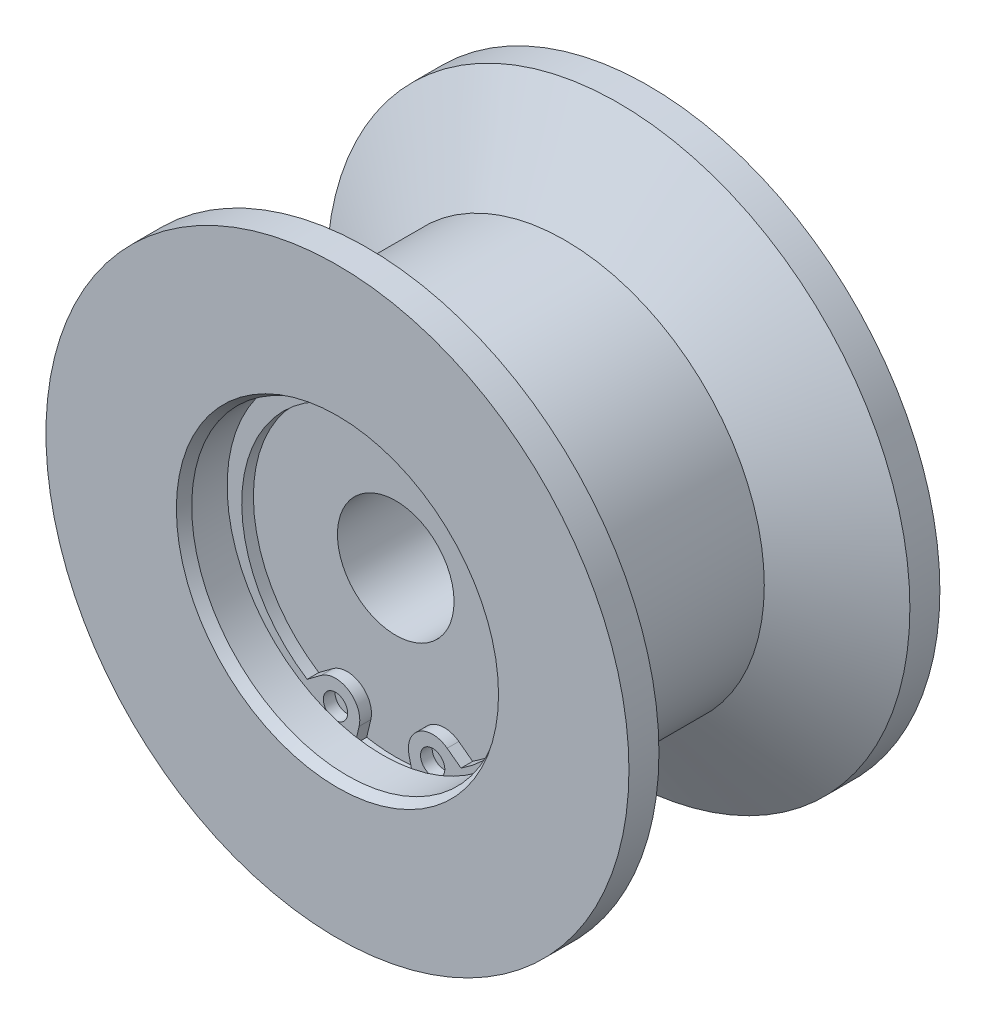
ISO-10303-21;
HEADER;
FILE_DESCRIPTION(('STEP AP214'),'2;1');
FILE_NAME('part.step','',(''),(''),'','','');
FILE_SCHEMA(('AUTOMOTIVE_DESIGN { 1 0 10303 214 1 1 1 1 }'));
ENDSEC;
DATA;
#1=APPLICATION_CONTEXT('core data for automotive mechanical design processes');
#2=APPLICATION_PROTOCOL_DEFINITION('international standard','automotive_design',2000,#1);
#3=PRODUCT_CONTEXT('',#1,'mechanical');
#4=PRODUCT('Part','Part','',(#3));
#5=PRODUCT_RELATED_PRODUCT_CATEGORY('part','',(#4));
#6=PRODUCT_DEFINITION_FORMATION('','',#4);
#7=PRODUCT_DEFINITION_CONTEXT('part definition',#1,'design');
#8=PRODUCT_DEFINITION('design','',#6,#7);
#9=PRODUCT_DEFINITION_SHAPE('','',#8);
#10=(LENGTH_UNIT() NAMED_UNIT(*) SI_UNIT(.MILLI.,.METRE.));
#11=(NAMED_UNIT(*) PLANE_ANGLE_UNIT() SI_UNIT($,.RADIAN.));
#12=(NAMED_UNIT(*) SI_UNIT($,.STERADIAN.) SOLID_ANGLE_UNIT());
#13=UNCERTAINTY_MEASURE_WITH_UNIT(LENGTH_MEASURE(1.E-05),#10,'distance_accuracy_value','');
#14=(GEOMETRIC_REPRESENTATION_CONTEXT(3) GLOBAL_UNCERTAINTY_ASSIGNED_CONTEXT((#13)) GLOBAL_UNIT_ASSIGNED_CONTEXT((#10,
#11,#12)) REPRESENTATION_CONTEXT('',''));
#15=CARTESIAN_POINT('',(0.,0.,0.));
#16=DIRECTION('',(0.,0.,1.));
#17=DIRECTION('',(1.,0.,0.));
#18=AXIS2_PLACEMENT_3D('',#15,#16,#17);
#19=CARTESIAN_POINT('',(17.0522,-17.110876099,10.));
#20=DIRECTION('',(0.,0.,-1.));
#21=DIRECTION('',(-1.,0.,0.));
#22=AXIS2_PLACEMENT_3D('',#19,#20,#21);
#23=PLANE('',#22);
#24=CARTESIAN_POINT('',(5.,-14.2233767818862,10.));
#25=DIRECTION('',(0.,0.,1.));
#26=DIRECTION('',(1.,0.,0.));
#27=AXIS2_PLACEMENT_3D('',#24,#25,#26);
#28=CIRCLE('',#27,1.25);
#29=CARTESIAN_POINT('',(6.25,-14.2233767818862,10.));
#30=VERTEX_POINT('',#29);
#31=EDGE_CURVE('E117',#30,#30,#28,.T.);
#32=ORIENTED_EDGE('',*,*,#31,.T.);
#33=EDGE_LOOP('',(#32));
#34=FACE_BOUND('',#33,.T.);
#35=ADVANCED_FACE('F14',(#34),#23,.F.);
#36=CARTESIAN_POINT('',(-5.,-14.2233767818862,10.));
#37=DIRECTION('',(0.,0.,-1.));
#38=DIRECTION('',(1.,0.,0.));
#39=AXIS2_PLACEMENT_3D('',#36,#37,#38);
#40=CIRCLE('',#39,1.25);
#41=CARTESIAN_POINT('',(-3.75,-14.2233767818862,10.));
#42=VERTEX_POINT('',#41);
#43=EDGE_CURVE('E143',#42,#42,#40,.T.);
#44=ORIENTED_EDGE('',*,*,#43,.F.);
#45=EDGE_LOOP('',(#44));
#46=FACE_BOUND('',#45,.T.);
#47=ADVANCED_FACE('F249',(#46),#23,.F.);
#48=CARTESIAN_POINT('',(0.,0.,-7.42820323));
#49=DIRECTION('',(0.,0.,1.));
#50=DIRECTION('',(1.,0.,0.));
#51=AXIS2_PLACEMENT_3D('',#48,#49,#50);
#52=CYLINDRICAL_SURFACE('',#51,20.5);
#53=CARTESIAN_POINT('',(0.,0.,7.42820323));
#54=DIRECTION('',(0.,0.,1.));
#55=DIRECTION('',(1.,0.,0.));
#56=AXIS2_PLACEMENT_3D('',#53,#54,#55);
#57=CIRCLE('',#56,20.5);
#58=CARTESIAN_POINT('',(20.5,0.,7.42820323));
#59=VERTEX_POINT('',#58);
#60=EDGE_CURVE('E188',#59,#59,#57,.F.);
#61=ORIENTED_EDGE('',*,*,#60,.T.);
#62=EDGE_LOOP('',(#61));
#63=FACE_BOUND('',#62,.T.);
#64=CARTESIAN_POINT('',(0.,0.,-7.42820323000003));
#65=DIRECTION('',(0.,0.,-1.));
#66=DIRECTION('',(-1.,0.,0.));
#67=AXIS2_PLACEMENT_3D('',#64,#65,#66);
#68=CIRCLE('',#67,20.5);
#69=CARTESIAN_POINT('',(-20.5,0.,-7.42820323));
#70=VERTEX_POINT('',#69);
#71=EDGE_CURVE('E184',#70,#70,#68,.T.);
#72=ORIENTED_EDGE('',*,*,#71,.F.);
#73=EDGE_LOOP('',(#72));
#74=FACE_BOUND('',#73,.T.);
#75=ADVANCED_FACE('F243',(#63,#74),#52,.T.);
#76=CARTESIAN_POINT('',(0.,0.,7.42820323));
#77=DIRECTION('',(0.,0.,1.));
#78=DIRECTION('',(1.,0.,0.));
#79=AXIS2_PLACEMENT_3D('',#76,#77,#78);
#80=CONICAL_SURFACE('',#79,20.5,1.04719755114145);
#81=CARTESIAN_POINT('',(0.,0.,12.913030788));
#82=DIRECTION('',(0.,0.,1.));
#83=DIRECTION('',(1.,0.,0.));
#84=AXIS2_PLACEMENT_3D('',#81,#82,#83);
#85=CIRCLE('',#84,30.);
#86=CARTESIAN_POINT('',(30.,0.,12.913030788));
#87=VERTEX_POINT('',#86);
#88=EDGE_CURVE('E192',#87,#87,#85,.F.);
#89=ORIENTED_EDGE('',*,*,#88,.T.);
#90=EDGE_LOOP('',(#89));
#91=FACE_BOUND('',#90,.T.);
#92=ORIENTED_EDGE('',*,*,#60,.F.);
#93=EDGE_LOOP('',(#92));
#94=FACE_BOUND('',#93,.T.);
#95=ADVANCED_FACE('F240',(#91,#94),#80,.T.);
#96=CARTESIAN_POINT('',(0.,0.,-7.42820323));
#97=DIRECTION('',(0.,0.,-1.));
#98=DIRECTION('',(-1.,0.,0.));
#99=AXIS2_PLACEMENT_3D('',#96,#97,#98);
#100=CONICAL_SURFACE('',#99,20.5,1.04719755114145);
#101=CARTESIAN_POINT('',(0.,0.,-12.913030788));
#102=DIRECTION('',(0.,0.,1.));
#103=DIRECTION('',(1.,0.,0.));
#104=AXIS2_PLACEMENT_3D('',#101,#102,#103);
#105=CIRCLE('',#104,30.);
#106=CARTESIAN_POINT('',(30.,0.,-12.913030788));
#107=VERTEX_POINT('',#106);
#108=EDGE_CURVE('E179',#107,#107,#105,.F.);
#109=ORIENTED_EDGE('',*,*,#108,.F.);
#110=EDGE_LOOP('',(#109));
#111=FACE_BOUND('',#110,.T.);
#112=ORIENTED_EDGE('',*,*,#71,.T.);
#113=EDGE_LOOP('',(#112));
#114=FACE_BOUND('',#113,.T.);
#115=ADVANCED_FACE('F236',(#111,#114),#100,.T.);
#116=CARTESIAN_POINT('',(0.,0.,12.913030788));
#117=DIRECTION('',(0.,0.,1.));
#118=DIRECTION('',(1.,0.,0.));
#119=AXIS2_PLACEMENT_3D('',#116,#117,#118);
#120=CYLINDRICAL_SURFACE('',#119,30.);
#121=CARTESIAN_POINT('',(0.,0.,16.));
#122=DIRECTION('',(0.,0.,1.));
#123=DIRECTION('',(1.,0.,0.));
#124=AXIS2_PLACEMENT_3D('',#121,#122,#123);
#125=CIRCLE('',#124,30.);
#126=CARTESIAN_POINT('',(30.,0.,16.));
#127=VERTEX_POINT('',#126);
#128=EDGE_CURVE('E199',#127,#127,#125,.F.);
#129=ORIENTED_EDGE('',*,*,#128,.T.);
#130=EDGE_LOOP('',(#129));
#131=FACE_BOUND('',#130,.T.);
#132=ORIENTED_EDGE('',*,*,#88,.F.);
#133=EDGE_LOOP('',(#132));
#134=FACE_BOUND('',#133,.T.);
#135=ADVANCED_FACE('F233',(#131,#134),#120,.T.);
#136=CARTESIAN_POINT('',(0.,0.,-16.));
#137=DIRECTION('',(0.,0.,1.));
#138=DIRECTION('',(1.,0.,0.));
#139=AXIS2_PLACEMENT_3D('',#136,#137,#138);
#140=CYLINDRICAL_SURFACE('',#139,30.);
#141=ORIENTED_EDGE('',*,*,#108,.T.);
#142=EDGE_LOOP('',(#141));
#143=FACE_BOUND('',#142,.T.);
#144=CARTESIAN_POINT('',(0.,0.,-16.));
#145=DIRECTION('',(0.,0.,1.));
#146=DIRECTION('',(1.,0.,0.));
#147=AXIS2_PLACEMENT_3D('',#144,#145,#146);
#148=CIRCLE('',#147,30.);
#149=CARTESIAN_POINT('',(30.,0.,-16.));
#150=VERTEX_POINT('',#149);
#151=EDGE_CURVE('E206',#150,#150,#148,.T.);
#152=ORIENTED_EDGE('',*,*,#151,.T.);
#153=EDGE_LOOP('',(#152));
#154=FACE_BOUND('',#153,.T.);
#155=ADVANCED_FACE('F229',(#143,#154),#140,.T.);
#156=CARTESIAN_POINT('',(30.36,-30.464467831,16.));
#157=DIRECTION('',(0.,0.,-1.));
#158=DIRECTION('',(-1.,0.,0.));
#159=AXIS2_PLACEMENT_3D('',#156,#157,#158);
#160=PLANE('',#159);
#161=CARTESIAN_POINT('',(0.,0.,16.));
#162=DIRECTION('',(0.,0.,1.));
#163=DIRECTION('',(1.,0.,0.));
#164=AXIS2_PLACEMENT_3D('',#161,#162,#163);
#165=CIRCLE('',#164,16.577350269);
#166=CARTESIAN_POINT('',(16.577350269,0.,16.));
#167=VERTEX_POINT('',#166);
#168=EDGE_CURVE('E200',#167,#167,#165,.T.);
#169=ORIENTED_EDGE('',*,*,#168,.F.);
#170=EDGE_LOOP('',(#169));
#171=FACE_BOUND('',#170,.T.);
#172=ORIENTED_EDGE('',*,*,#128,.F.);
#173=EDGE_LOOP('',(#172));
#174=FACE_BOUND('',#173,.T.);
#175=ADVANCED_FACE('F226',(#171,#174),#160,.F.);
#176=CARTESIAN_POINT('',(-30.36,-30.464467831,-16.));
#177=DIRECTION('',(0.,0.,1.));
#178=DIRECTION('',(1.,0.,0.));
#179=AXIS2_PLACEMENT_3D('',#176,#177,#178);
#180=PLANE('',#179);
#181=CARTESIAN_POINT('',(0.,0.,-16.));
#182=DIRECTION('',(0.,0.,1.));
#183=DIRECTION('',(1.,0.,0.));
#184=AXIS2_PLACEMENT_3D('',#181,#182,#183);
#185=CIRCLE('',#184,13.);
#186=CARTESIAN_POINT('',(13.,0.,-16.));
#187=VERTEX_POINT('',#186);
#188=EDGE_CURVE('E144',#187,#187,#185,.T.);
#189=ORIENTED_EDGE('',*,*,#188,.T.);
#190=EDGE_LOOP('',(#189));
#191=FACE_BOUND('',#190,.T.);
#192=ORIENTED_EDGE('',*,*,#151,.F.);
#193=EDGE_LOOP('',(#192));
#194=FACE_BOUND('',#193,.T.);
#195=ADVANCED_FACE('F16',(#191,#194),#180,.F.);
#196=CARTESIAN_POINT('',(0.,0.,15.));
#197=DIRECTION('',(0.,0.,1.));
#198=DIRECTION('',(1.,0.,0.));
#199=AXIS2_PLACEMENT_3D('',#196,#197,#198);
#200=CONICAL_SURFACE('',#199,16.,0.523598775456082);
#201=CARTESIAN_POINT('',(0.,0.,15.));
#202=DIRECTION('',(0.,0.,1.));
#203=DIRECTION('',(1.,0.,0.));
#204=AXIS2_PLACEMENT_3D('',#201,#202,#203);
#205=CIRCLE('',#204,16.);
#206=CARTESIAN_POINT('',(16.,0.,15.));
#207=VERTEX_POINT('',#206);
#208=EDGE_CURVE('E196',#207,#207,#205,.F.);
#209=ORIENTED_EDGE('',*,*,#208,.T.);
#210=EDGE_LOOP('',(#209));
#211=FACE_BOUND('',#210,.T.);
#212=ORIENTED_EDGE('',*,*,#168,.T.);
#213=EDGE_LOOP('',(#212));
#214=FACE_BOUND('',#213,.T.);
#215=ADVANCED_FACE('F224',(#211,#214),#200,.F.);
#216=CARTESIAN_POINT('',(0.,0.,-16.));
#217=DIRECTION('',(0.,0.,1.));
#218=DIRECTION('',(1.,0.,0.));
#219=AXIS2_PLACEMENT_3D('',#216,#217,#218);
#220=CYLINDRICAL_SURFACE('',#219,13.);
#221=CARTESIAN_POINT('',(0.,0.,-10.));
#222=DIRECTION('',(0.,0.,1.));
#223=DIRECTION('',(1.,0.,0.));
#224=AXIS2_PLACEMENT_3D('',#221,#222,#223);
#225=CIRCLE('',#224,13.);
#226=CARTESIAN_POINT('',(13.,0.,-10.));
#227=VERTEX_POINT('',#226);
#228=EDGE_CURVE('E203',#227,#227,#225,.F.);
#229=ORIENTED_EDGE('',*,*,#228,.F.);
#230=EDGE_LOOP('',(#229));
#231=FACE_BOUND('',#230,.T.);
#232=ORIENTED_EDGE('',*,*,#188,.F.);
#233=EDGE_LOOP('',(#232));
#234=FACE_BOUND('',#233,.T.);
#235=ADVANCED_FACE('F294',(#231,#234),#220,.F.);
#236=CARTESIAN_POINT('',(0.,0.,11.35));
#237=DIRECTION('',(0.,0.,1.));
#238=DIRECTION('',(0.,-1.,0.));
#239=AXIS2_PLACEMENT_3D('',#236,#237,#238);
#240=CYLINDRICAL_SURFACE('',#239,16.);
#241=CARTESIAN_POINT('',(0.,0.,11.35));
#242=DIRECTION('',(0.,0.,1.));
#243=DIRECTION('',(0.,-1.,0.));
#244=AXIS2_PLACEMENT_3D('',#241,#242,#243);
#245=CIRCLE('',#244,16.);
#246=CARTESIAN_POINT('',(0.,-16.,11.35));
#247=VERTEX_POINT('',#246);
#248=EDGE_CURVE('E195',#247,#247,#245,.F.);
#249=ORIENTED_EDGE('',*,*,#248,.T.);
#250=EDGE_LOOP('',(#249));
#251=FACE_BOUND('',#250,.T.);
#252=ORIENTED_EDGE('',*,*,#208,.F.);
#253=EDGE_LOOP('',(#252));
#254=FACE_BOUND('',#253,.T.);
#255=ADVANCED_FACE('F296',(#251,#254),#240,.F.);
#256=CARTESIAN_POINT('',(-13.156,-13.201269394,-10.));
#257=DIRECTION('',(0.,0.,1.));
#258=DIRECTION('',(1.,0.,0.));
#259=AXIS2_PLACEMENT_3D('',#256,#257,#258);
#260=PLANE('',#259);
#261=CARTESIAN_POINT('',(0.,0.,-10.));
#262=DIRECTION('',(0.,0.,1.));
#263=DIRECTION('',(1.,0.,0.));
#264=AXIS2_PLACEMENT_3D('',#261,#262,#263);
#265=CIRCLE('',#264,6.);
#266=CARTESIAN_POINT('',(6.,0.,-10.));
#267=VERTEX_POINT('',#266);
#268=EDGE_CURVE('E182',#267,#267,#265,.F.);
#269=ORIENTED_EDGE('',*,*,#268,.F.);
#270=EDGE_LOOP('',(#269));
#271=FACE_BOUND('',#270,.T.);
#272=ORIENTED_EDGE('',*,*,#228,.T.);
#273=EDGE_LOOP('',(#272));
#274=FACE_BOUND('',#273,.T.);
#275=ADVANCED_FACE('F298',(#271,#274),#260,.F.);
#276=CARTESIAN_POINT('',(-17.0522,-17.110876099,11.35));
#277=DIRECTION('',(0.,0.,1.));
#278=DIRECTION('',(1.,0.,0.));
#279=AXIS2_PLACEMENT_3D('',#276,#277,#278);
#280=PLANE('',#279);
#281=ORIENTED_EDGE('',*,*,#248,.F.);
#282=EDGE_LOOP('',(#281));
#283=FACE_BOUND('',#282,.T.);
#284=CARTESIAN_POINT('',(0.,0.,11.35));
#285=DIRECTION('',(0.,0.,1.));
#286=DIRECTION('',(0.,-1.,0.));
#287=AXIS2_PLACEMENT_3D('',#284,#285,#286);
#288=CIRCLE('',#287,16.85);
#289=CARTESIAN_POINT('',(0.,-16.85,11.35));
#290=VERTEX_POINT('',#289);
#291=EDGE_CURVE('E191',#290,#290,#288,.F.);
#292=ORIENTED_EDGE('',*,*,#291,.T.);
#293=EDGE_LOOP('',(#292));
#294=FACE_BOUND('',#293,.T.);
#295=ADVANCED_FACE('F303',(#283,#294),#280,.F.);
#296=CARTESIAN_POINT('',(0.,0.,10.));
#297=DIRECTION('',(0.,0.,1.));
#298=DIRECTION('',(0.,-1.,0.));
#299=AXIS2_PLACEMENT_3D('',#296,#297,#298);
#300=CYLINDRICAL_SURFACE('',#299,16.85);
#301=ORIENTED_EDGE('',*,*,#291,.F.);
#302=EDGE_LOOP('',(#301));
#303=FACE_BOUND('',#302,.T.);
#304=DIRECTION('',(0.,0.,1.));
#305=VECTOR('',#304,1.);
#306=CARTESIAN_POINT('',(2.99125499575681,-16.5823669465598,10.));
#307=LINE('',#306,#305);
#308=CARTESIAN_POINT('',(2.99125499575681,-16.5823669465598,10.));
#309=VERTEX_POINT('',#308);
#310=CARTESIAN_POINT('',(2.99125499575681,-16.5823669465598,11.2));
#311=VERTEX_POINT('',#310);
#312=EDGE_CURVE('E18',#309,#311,#307,.T.);
#313=ORIENTED_EDGE('',*,*,#312,.F.);
#314=CARTESIAN_POINT('',(0.,0.,10.));
#315=DIRECTION('',(0.,0.,1.));
#316=DIRECTION('',(0.,-1.,0.));
#317=AXIS2_PLACEMENT_3D('',#314,#315,#316);
#318=CIRCLE('',#317,16.85);
#319=CARTESIAN_POINT('',(-2.99125499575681,-16.5823669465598,10.));
#320=VERTEX_POINT('',#319);
#321=EDGE_CURVE('E187',#309,#320,#318,.F.);
#322=ORIENTED_EDGE('',*,*,#321,.T.);
#323=DIRECTION('',(0.,0.,1.));
#324=VECTOR('',#323,1.);
#325=CARTESIAN_POINT('',(-2.99125499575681,-16.5823669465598,10.));
#326=LINE('',#325,#324);
#327=CARTESIAN_POINT('',(-2.99125499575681,-16.5823669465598,11.2));
#328=VERTEX_POINT('',#327);
#329=EDGE_CURVE('E176',#328,#320,#326,.F.);
#330=ORIENTED_EDGE('',*,*,#329,.F.);
#331=CARTESIAN_POINT('',(0.,0.,11.2));
#332=DIRECTION('',(0.,0.,-1.));
#333=DIRECTION('',(-1.,0.,0.));
#334=AXIS2_PLACEMENT_3D('',#331,#332,#333);
#335=CIRCLE('',#334,16.85);
#336=EDGE_CURVE('E9',#311,#328,#335,.F.);
#337=ORIENTED_EDGE('',*,*,#336,.F.);
#338=EDGE_LOOP('',(#313,#322,#330,#337));
#339=FACE_BOUND('',#338,.T.);
#340=ADVANCED_FACE('F301',(#303,#339),#300,.F.);
#341=CARTESIAN_POINT('',(0.,0.,-10.));
#342=DIRECTION('',(0.,0.,1.));
#343=DIRECTION('',(1.,0.,0.));
#344=AXIS2_PLACEMENT_3D('',#341,#342,#343);
#345=CYLINDRICAL_SURFACE('',#344,6.);
#346=ORIENTED_EDGE('',*,*,#268,.T.);
#347=EDGE_LOOP('',(#346));
#348=FACE_BOUND('',#347,.T.);
#349=CARTESIAN_POINT('',(0.,0.,10.));
#350=DIRECTION('',(0.,0.,1.));
#351=DIRECTION('',(1.,0.,0.));
#352=AXIS2_PLACEMENT_3D('',#349,#350,#351);
#353=CIRCLE('',#352,6.);
#354=CARTESIAN_POINT('',(6.,0.,10.));
#355=VERTEX_POINT('',#354);
#356=EDGE_CURVE('E183',#355,#355,#353,.F.);
#357=ORIENTED_EDGE('',*,*,#356,.F.);
#358=EDGE_LOOP('',(#357));
#359=FACE_BOUND('',#358,.T.);
#360=ADVANCED_FACE('F273',(#348,#359),#345,.F.);
#361=ORIENTED_EDGE('',*,*,#356,.T.);
#362=EDGE_LOOP('',(#361));
#363=FACE_BOUND('',#362,.T.);
#364=ORIENTED_EDGE('',*,*,#321,.F.);
#365=DIRECTION('',(0.231349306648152,-0.972870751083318,0.));
#366=VECTOR('',#365,1.);
#367=CARTESIAN_POINT('',(2.5678231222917,-14.8017500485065,10.));
#368=LINE('',#367,#366);
#369=CARTESIAN_POINT('',(2.5678231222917,-14.8017500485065,10.));
#370=VERTEX_POINT('',#369);
#371=EDGE_CURVE('E34',#370,#309,#368,.T.);
#372=ORIENTED_EDGE('',*,*,#371,.F.);
#373=CARTESIAN_POINT('',(5.,-14.2233767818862,10.));
#374=DIRECTION('',(0.,0.,1.));
#375=DIRECTION('',(1.,0.,0.));
#376=AXIS2_PLACEMENT_3D('',#373,#374,#375);
#377=CIRCLE('',#376,2.5);
#378=CARTESIAN_POINT('',(6.49138441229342,-12.2169439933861,10.));
#379=VERTEX_POINT('',#378);
#380=EDGE_CURVE('E134',#379,#370,#377,.T.);
#381=ORIENTED_EDGE('',*,*,#380,.F.);
#382=DIRECTION('',(-0.802573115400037,0.596553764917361,0.));
#383=VECTOR('',#382,1.);
#384=CARTESIAN_POINT('',(6.49138441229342,-12.2169439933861,10.));
#385=LINE('',#384,#383);
#386=CARTESIAN_POINT('',(7.91695293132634,-13.2765711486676,10.));
#387=VERTEX_POINT('',#386);
#388=EDGE_CURVE('E148',#387,#379,#385,.T.);
#389=ORIENTED_EDGE('',*,*,#388,.F.);
#390=CARTESIAN_POINT('',(0.,-0.95,10.));
#391=DIRECTION('',(0.,0.,-1.));
#392=DIRECTION('',(0.,-1.,0.));
#393=AXIS2_PLACEMENT_3D('',#390,#391,#392);
#394=CIRCLE('',#393,14.65);
#395=CARTESIAN_POINT('',(-7.91695293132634,-13.2765711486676,10.));
#396=VERTEX_POINT('',#395);
#397=EDGE_CURVE('E163',#396,#387,#394,.T.);
#398=ORIENTED_EDGE('',*,*,#397,.F.);
#399=DIRECTION('',(-0.802573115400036,-0.596553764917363,0.));
#400=VECTOR('',#399,1.);
#401=CARTESIAN_POINT('',(-6.49138441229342,-12.2169439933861,10.));
#402=LINE('',#401,#400);
#403=CARTESIAN_POINT('',(-6.49138441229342,-12.2169439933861,10.));
#404=VERTEX_POINT('',#403);
#405=EDGE_CURVE('E116',#404,#396,#402,.T.);
#406=ORIENTED_EDGE('',*,*,#405,.F.);
#407=CARTESIAN_POINT('',(-5.,-14.2233767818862,10.));
#408=DIRECTION('',(0.,0.,1.));
#409=DIRECTION('',(-1.,0.,0.));
#410=AXIS2_PLACEMENT_3D('',#407,#408,#409);
#411=CIRCLE('',#410,2.5);
#412=CARTESIAN_POINT('',(-2.56782312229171,-14.8017500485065,10.));
#413=VERTEX_POINT('',#412);
#414=EDGE_CURVE('E113',#413,#404,#411,.T.);
#415=ORIENTED_EDGE('',*,*,#414,.F.);
#416=DIRECTION('',(0.231349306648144,0.97287075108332,0.));
#417=VECTOR('',#416,1.);
#418=CARTESIAN_POINT('',(-2.56782312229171,-14.8017500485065,10.));
#419=LINE('',#418,#417);
#420=EDGE_CURVE('E155',#320,#413,#419,.T.);
#421=ORIENTED_EDGE('',*,*,#420,.F.);
#422=EDGE_LOOP('',(#364,#372,#381,#389,#398,#406,#415,#421));
#423=FACE_BOUND('',#422,.T.);
#424=ADVANCED_FACE('F264',(#363,#423),#23,.F.);
#425=CARTESIAN_POINT('',(0.,-0.95,11.2));
#426=DIRECTION('',(0.,0.,1.));
#427=DIRECTION('',(-1.,0.,0.));
#428=AXIS2_PLACEMENT_3D('',#425,#426,#427);
#429=CYLINDRICAL_SURFACE('',#428,14.65);
#430=ORIENTED_EDGE('',*,*,#397,.T.);
#431=DIRECTION('',(0.,0.,-1.));
#432=VECTOR('',#431,1.);
#433=CARTESIAN_POINT('',(7.91695293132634,-13.2765711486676,11.2));
#434=LINE('',#433,#432);
#435=CARTESIAN_POINT('',(7.91695293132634,-13.2765711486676,11.2));
#436=VERTEX_POINT('',#435);
#437=EDGE_CURVE('E103',#436,#387,#434,.T.);
#438=ORIENTED_EDGE('',*,*,#437,.F.);
#439=CARTESIAN_POINT('',(0.,-0.95,11.2));
#440=DIRECTION('',(0.,0.,-1.));
#441=DIRECTION('',(0.,-1.,0.));
#442=AXIS2_PLACEMENT_3D('',#439,#440,#441);
#443=CIRCLE('',#442,14.65);
#444=CARTESIAN_POINT('',(-7.91695293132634,-13.2765711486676,11.2));
#445=VERTEX_POINT('',#444);
#446=EDGE_CURVE('E104',#445,#436,#443,.T.);
#447=ORIENTED_EDGE('',*,*,#446,.F.);
#448=DIRECTION('',(0.,0.,-1.));
#449=VECTOR('',#448,1.);
#450=CARTESIAN_POINT('',(-7.91695293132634,-13.2765711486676,11.2));
#451=LINE('',#450,#449);
#452=EDGE_CURVE('E98',#445,#396,#451,.T.);
#453=ORIENTED_EDGE('',*,*,#452,.T.);
#454=EDGE_LOOP('',(#430,#438,#447,#453));
#455=FACE_BOUND('',#454,.T.);
#456=ADVANCED_FACE('F265',(#455),#429,.F.);
#457=CARTESIAN_POINT('',(6.49138441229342,-12.2169439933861,11.2));
#458=DIRECTION('',(-0.596553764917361,-0.802573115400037,0.));
#459=DIRECTION('',(-0.802573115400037,0.596553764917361,0.));
#460=AXIS2_PLACEMENT_3D('',#457,#458,#459);
#461=PLANE('',#460);
#462=ORIENTED_EDGE('',*,*,#388,.T.);
#463=DIRECTION('',(0.,0.,-1.));
#464=VECTOR('',#463,1.);
#465=CARTESIAN_POINT('',(6.49138441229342,-12.2169439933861,11.2));
#466=LINE('',#465,#464);
#467=CARTESIAN_POINT('',(6.49138441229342,-12.2169439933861,11.2));
#468=VERTEX_POINT('',#467);
#469=EDGE_CURVE('E153',#468,#379,#466,.T.);
#470=ORIENTED_EDGE('',*,*,#469,.F.);
#471=DIRECTION('',(-0.802573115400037,0.596553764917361,0.));
#472=VECTOR('',#471,1.);
#473=CARTESIAN_POINT('',(6.49138441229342,-12.2169439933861,11.2));
#474=LINE('',#473,#472);
#475=EDGE_CURVE('E138',#436,#468,#474,.T.);
#476=ORIENTED_EDGE('',*,*,#475,.F.);
#477=ORIENTED_EDGE('',*,*,#437,.T.);
#478=EDGE_LOOP('',(#462,#470,#476,#477));
#479=FACE_BOUND('',#478,.T.);
#480=ADVANCED_FACE('F276',(#479),#461,.F.);
#481=CARTESIAN_POINT('',(5.,-14.2233767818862,11.2));
#482=DIRECTION('',(0.,0.,1.));
#483=DIRECTION('',(-1.,0.,0.));
#484=AXIS2_PLACEMENT_3D('',#481,#482,#483);
#485=CYLINDRICAL_SURFACE('',#484,2.5);
#486=ORIENTED_EDGE('',*,*,#380,.T.);
#487=DIRECTION('',(0.,0.,-1.));
#488=VECTOR('',#487,1.);
#489=CARTESIAN_POINT('',(2.5678231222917,-14.8017500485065,11.2));
#490=LINE('',#489,#488);
#491=CARTESIAN_POINT('',(2.5678231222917,-14.8017500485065,11.2));
#492=VERTEX_POINT('',#491);
#493=EDGE_CURVE('E154',#492,#370,#490,.T.);
#494=ORIENTED_EDGE('',*,*,#493,.F.);
#495=CARTESIAN_POINT('',(5.,-14.2233767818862,11.2));
#496=DIRECTION('',(0.,0.,1.));
#497=DIRECTION('',(1.,0.,0.));
#498=AXIS2_PLACEMENT_3D('',#495,#496,#497);
#499=CIRCLE('',#498,2.5);
#500=EDGE_CURVE('E167',#468,#492,#499,.T.);
#501=ORIENTED_EDGE('',*,*,#500,.F.);
#502=ORIENTED_EDGE('',*,*,#469,.T.);
#503=EDGE_LOOP('',(#486,#494,#501,#502));
#504=FACE_BOUND('',#503,.T.);
#505=ADVANCED_FACE('F282',(#504),#485,.T.);
#506=CARTESIAN_POINT('',(-2.56782312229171,-14.8017500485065,11.2));
#507=DIRECTION('',(-0.97287075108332,0.231349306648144,0.));
#508=DIRECTION('',(0.,0.,1.));
#509=AXIS2_PLACEMENT_3D('',#506,#507,#508);
#510=PLANE('',#509);
#511=DIRECTION('',(0.231349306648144,0.97287075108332,0.));
#512=VECTOR('',#511,1.);
#513=CARTESIAN_POINT('',(-2.56782312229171,-14.8017500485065,11.2));
#514=LINE('',#513,#512);
#515=CARTESIAN_POINT('',(-2.56782312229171,-14.8017500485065,11.2));
#516=VERTEX_POINT('',#515);
#517=EDGE_CURVE('E122',#328,#516,#514,.T.);
#518=ORIENTED_EDGE('',*,*,#517,.F.);
#519=ORIENTED_EDGE('',*,*,#329,.T.);
#520=ORIENTED_EDGE('',*,*,#420,.T.);
#521=DIRECTION('',(0.,0.,-1.));
#522=VECTOR('',#521,1.);
#523=CARTESIAN_POINT('',(-2.56782312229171,-14.8017500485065,11.2));
#524=LINE('',#523,#522);
#525=EDGE_CURVE('E172',#516,#413,#524,.T.);
#526=ORIENTED_EDGE('',*,*,#525,.F.);
#527=EDGE_LOOP('',(#518,#519,#520,#526));
#528=FACE_BOUND('',#527,.T.);
#529=ADVANCED_FACE('F290',(#528),#510,.F.);
#530=CARTESIAN_POINT('',(0.,-0.95,11.2));
#531=DIRECTION('',(0.,0.,-1.));
#532=DIRECTION('',(0.,-1.,0.));
#533=AXIS2_PLACEMENT_3D('',#530,#531,#532);
#534=PLANE('',#533);
#535=CARTESIAN_POINT('',(-5.,-14.2233767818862,11.2));
#536=DIRECTION('',(0.,0.,-1.));
#537=DIRECTION('',(1.,0.,0.));
#538=AXIS2_PLACEMENT_3D('',#535,#536,#537);
#539=CIRCLE('',#538,1.25);
#540=CARTESIAN_POINT('',(-3.75,-14.2233767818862,11.2));
#541=VERTEX_POINT('',#540);
#542=EDGE_CURVE('E124',#541,#541,#539,.T.);
#543=ORIENTED_EDGE('',*,*,#542,.T.);
#544=EDGE_LOOP('',(#543));
#545=FACE_BOUND('',#544,.T.);
#546=CARTESIAN_POINT('',(5.,-14.2233767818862,11.2));
#547=DIRECTION('',(0.,0.,1.));
#548=DIRECTION('',(1.,0.,0.));
#549=AXIS2_PLACEMENT_3D('',#546,#547,#548);
#550=CIRCLE('',#549,1.25);
#551=CARTESIAN_POINT('',(6.25,-14.2233767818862,11.2));
#552=VERTEX_POINT('',#551);
#553=EDGE_CURVE('E140',#552,#552,#550,.T.);
#554=ORIENTED_EDGE('',*,*,#553,.F.);
#555=EDGE_LOOP('',(#554));
#556=FACE_BOUND('',#555,.T.);
#557=DIRECTION('',(0.231349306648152,-0.972870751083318,0.));
#558=VECTOR('',#557,1.);
#559=CARTESIAN_POINT('',(2.5678231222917,-14.8017500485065,11.2));
#560=LINE('',#559,#558);
#561=EDGE_CURVE('E130',#492,#311,#560,.T.);
#562=ORIENTED_EDGE('',*,*,#561,.T.);
#563=ORIENTED_EDGE('',*,*,#336,.T.);
#564=ORIENTED_EDGE('',*,*,#517,.T.);
#565=CARTESIAN_POINT('',(-5.,-14.2233767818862,11.2));
#566=DIRECTION('',(0.,0.,1.));
#567=DIRECTION('',(-1.,0.,0.));
#568=AXIS2_PLACEMENT_3D('',#565,#566,#567);
#569=CIRCLE('',#568,2.5);
#570=CARTESIAN_POINT('',(-6.49138441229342,-12.2169439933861,11.2));
#571=VERTEX_POINT('',#570);
#572=EDGE_CURVE('E110',#516,#571,#569,.T.);
#573=ORIENTED_EDGE('',*,*,#572,.T.);
#574=DIRECTION('',(-0.802573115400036,-0.596553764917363,0.));
#575=VECTOR('',#574,1.);
#576=CARTESIAN_POINT('',(-6.49138441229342,-12.2169439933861,11.2));
#577=LINE('',#576,#575);
#578=EDGE_CURVE('E93',#571,#445,#577,.T.);
#579=ORIENTED_EDGE('',*,*,#578,.T.);
#580=ORIENTED_EDGE('',*,*,#446,.T.);
#581=ORIENTED_EDGE('',*,*,#475,.T.);
#582=ORIENTED_EDGE('',*,*,#500,.T.);
#583=EDGE_LOOP('',(#562,#563,#564,#573,#579,#580,#581,#582));
#584=FACE_BOUND('',#583,.T.);
#585=ADVANCED_FACE('F120',(#545,#556,#584),#534,.F.);
#586=CARTESIAN_POINT('',(5.,-14.2233767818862,11.2));
#587=DIRECTION('',(0.,0.,1.));
#588=DIRECTION('',(-1.,0.,0.));
#589=AXIS2_PLACEMENT_3D('',#586,#587,#588);
#590=CYLINDRICAL_SURFACE('',#589,1.25);
#591=ORIENTED_EDGE('',*,*,#31,.F.);
#592=EDGE_LOOP('',(#591));
#593=FACE_BOUND('',#592,.T.);
#594=ORIENTED_EDGE('',*,*,#553,.T.);
#595=EDGE_LOOP('',(#594));
#596=FACE_BOUND('',#595,.T.);
#597=ADVANCED_FACE('F360',(#593,#596),#590,.F.);
#598=CARTESIAN_POINT('',(-5.,-14.2233767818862,11.2));
#599=DIRECTION('',(0.,0.,1.));
#600=DIRECTION('',(-1.,0.,0.));
#601=AXIS2_PLACEMENT_3D('',#598,#599,#600);
#602=CYLINDRICAL_SURFACE('',#601,1.25);
#603=ORIENTED_EDGE('',*,*,#43,.T.);
#604=EDGE_LOOP('',(#603));
#605=FACE_BOUND('',#604,.T.);
#606=ORIENTED_EDGE('',*,*,#542,.F.);
#607=EDGE_LOOP('',(#606));
#608=FACE_BOUND('',#607,.T.);
#609=ADVANCED_FACE('F356',(#605,#608),#602,.F.);
#610=CARTESIAN_POINT('',(-6.49138441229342,-12.2169439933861,11.2));
#611=DIRECTION('',(0.596553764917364,-0.802573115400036,0.));
#612=DIRECTION('',(0.,0.,-1.));
#613=AXIS2_PLACEMENT_3D('',#610,#611,#612);
#614=PLANE('',#613);
#615=ORIENTED_EDGE('',*,*,#405,.T.);
#616=ORIENTED_EDGE('',*,*,#452,.F.);
#617=ORIENTED_EDGE('',*,*,#578,.F.);
#618=DIRECTION('',(0.,0.,-1.));
#619=VECTOR('',#618,1.);
#620=CARTESIAN_POINT('',(-6.49138441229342,-12.2169439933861,11.2));
#621=LINE('',#620,#619);
#622=EDGE_CURVE('E96',#571,#404,#621,.T.);
#623=ORIENTED_EDGE('',*,*,#622,.T.);
#624=EDGE_LOOP('',(#615,#616,#617,#623));
#625=FACE_BOUND('',#624,.T.);
#626=ADVANCED_FACE('F95',(#625),#614,.F.);
#627=CARTESIAN_POINT('',(-5.,-14.2233767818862,11.2));
#628=DIRECTION('',(0.,0.,1.));
#629=DIRECTION('',(-1.,0.,0.));
#630=AXIS2_PLACEMENT_3D('',#627,#628,#629);
#631=CYLINDRICAL_SURFACE('',#630,2.5);
#632=ORIENTED_EDGE('',*,*,#414,.T.);
#633=ORIENTED_EDGE('',*,*,#622,.F.);
#634=ORIENTED_EDGE('',*,*,#572,.F.);
#635=ORIENTED_EDGE('',*,*,#525,.T.);
#636=EDGE_LOOP('',(#632,#633,#634,#635));
#637=FACE_BOUND('',#636,.T.);
#638=ADVANCED_FACE('F108',(#637),#631,.T.);
#639=CARTESIAN_POINT('',(2.5678231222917,-14.8017500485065,11.2));
#640=DIRECTION('',(0.972870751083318,0.231349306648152,0.));
#641=DIRECTION('',(0.,0.,-1.));
#642=AXIS2_PLACEMENT_3D('',#639,#640,#641);
#643=PLANE('',#642);
#644=ORIENTED_EDGE('',*,*,#371,.T.);
#645=ORIENTED_EDGE('',*,*,#312,.T.);
#646=ORIENTED_EDGE('',*,*,#561,.F.);
#647=ORIENTED_EDGE('',*,*,#493,.T.);
#648=EDGE_LOOP('',(#644,#645,#646,#647));
#649=FACE_BOUND('',#648,.T.);
#650=ADVANCED_FACE('F270',(#649),#643,.F.);
#651=CLOSED_SHELL('',(#35,#47,#75,#95,#115,#135,#155,#175,#195,#215,#235,#255,#275,#295,#340,
#360,#424,#456,#480,#505,#529,#585,#597,#609,#626,#638,#650));
#652=MANIFOLD_SOLID_BREP('B1',#651);
#653=ADVANCED_BREP_SHAPE_REPRESENTATION('',(#18,#652),#14);
#654=SHAPE_DEFINITION_REPRESENTATION(#9,#653);
ENDSEC;
END-ISO-10303-21;
